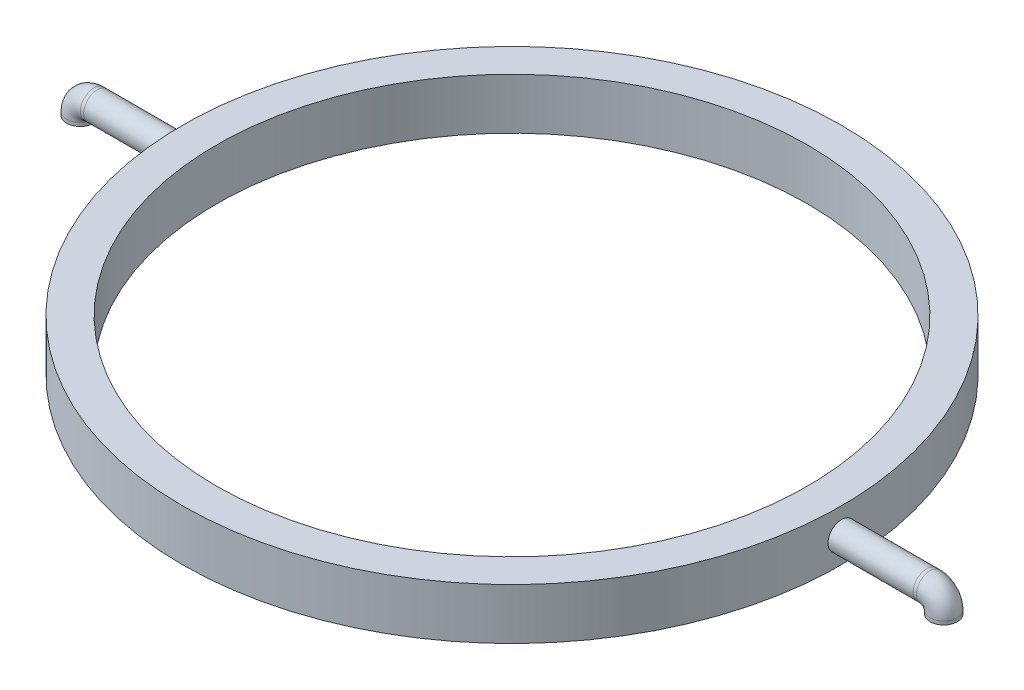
ISO-10303-21;
HEADER;
FILE_DESCRIPTION(('STEP AP214'),'2;1');
FILE_NAME('part.step','',(''),(''),'','','');
FILE_SCHEMA(('AUTOMOTIVE_DESIGN { 1 0 10303 214 1 1 1 1 }'));
ENDSEC;
DATA;
#1=APPLICATION_CONTEXT('core data for automotive mechanical design processes');
#2=APPLICATION_PROTOCOL_DEFINITION('international standard','automotive_design',2000,#1);
#3=PRODUCT_CONTEXT('',#1,'mechanical');
#4=PRODUCT('Part','Part','',(#3));
#5=PRODUCT_RELATED_PRODUCT_CATEGORY('part','',(#4));
#6=PRODUCT_DEFINITION_FORMATION('','',#4);
#7=PRODUCT_DEFINITION_CONTEXT('part definition',#1,'design');
#8=PRODUCT_DEFINITION('design','',#6,#7);
#9=PRODUCT_DEFINITION_SHAPE('','',#8);
#10=(LENGTH_UNIT() NAMED_UNIT(*) SI_UNIT(.MILLI.,.METRE.));
#11=(NAMED_UNIT(*) PLANE_ANGLE_UNIT() SI_UNIT($,.RADIAN.));
#12=(NAMED_UNIT(*) SI_UNIT($,.STERADIAN.) SOLID_ANGLE_UNIT());
#13=UNCERTAINTY_MEASURE_WITH_UNIT(LENGTH_MEASURE(1.E-05),#10,'distance_accuracy_value','');
#14=(GEOMETRIC_REPRESENTATION_CONTEXT(3) GLOBAL_UNCERTAINTY_ASSIGNED_CONTEXT((#13)) GLOBAL_UNIT_ASSIGNED_CONTEXT((#10,
#11,#12)) REPRESENTATION_CONTEXT('',''));
#15=CARTESIAN_POINT('',(0.,0.,0.));
#16=DIRECTION('',(0.,0.,1.));
#17=DIRECTION('',(1.,0.,0.));
#18=AXIS2_PLACEMENT_3D('',#15,#16,#17);
#19=CARTESIAN_POINT('',(-96.8,7.5,0.));
#20=DIRECTION('',(-1.,0.,0.));
#21=DIRECTION('',(0.,0.,-1.));
#22=AXIS2_PLACEMENT_3D('',#19,#20,#21);
#23=PLANE('',#22);
#24=CARTESIAN_POINT('',(-96.8,7.5,0.));
#25=DIRECTION('',(1.,0.,0.));
#26=DIRECTION('',(0.,0.,-1.));
#27=AXIS2_PLACEMENT_3D('',#24,#25,#26);
#28=CIRCLE('',#27,4.);
#29=CARTESIAN_POINT('',(-96.8,7.5,-4.));
#30=VERTEX_POINT('',#29);
#31=EDGE_CURVE('E58',#30,#30,#28,.T.);
#32=ORIENTED_EDGE('',*,*,#31,.T.);
#33=EDGE_LOOP('',(#32));
#34=FACE_BOUND('',#33,.T.);
#35=ADVANCED_FACE('F46',(#34),#23,.F.);
#36=CARTESIAN_POINT('',(-126.8,2.5,0.));
#37=DIRECTION('',(0.,-1.,0.));
#38=DIRECTION('',(0.,0.,-1.));
#39=AXIS2_PLACEMENT_3D('',#36,#37,#38);
#40=PLANE('',#39);
#41=CARTESIAN_POINT('',(-126.8,2.5,0.));
#42=DIRECTION('',(0.,1.,0.));
#43=DIRECTION('',(0.,0.,-1.));
#44=AXIS2_PLACEMENT_3D('',#41,#42,#43);
#45=CIRCLE('',#44,4.);
#46=CARTESIAN_POINT('',(-126.8,2.5,-4.));
#47=VERTEX_POINT('',#46);
#48=EDGE_CURVE('E12',#47,#47,#45,.T.);
#49=ORIENTED_EDGE('',*,*,#48,.F.);
#50=EDGE_LOOP('',(#49));
#51=FACE_BOUND('',#50,.T.);
#52=ADVANCED_FACE('F91',(#51),#40,.T.);
#53=CARTESIAN_POINT('',(-96.8,7.5,0.));
#54=DIRECTION('',(-1.,0.,0.));
#55=DIRECTION('',(0.,1.,0.));
#56=AXIS2_PLACEMENT_3D('',#53,#54,#55);
#57=CYLINDRICAL_SURFACE('',#56,4.);
#58=CARTESIAN_POINT('',(-121.8,7.5,0.));
#59=DIRECTION('',(1.,0.,0.));
#60=DIRECTION('',(0.,0.,-1.));
#61=AXIS2_PLACEMENT_3D('',#58,#59,#60);
#62=CIRCLE('',#61,4.);
#63=CARTESIAN_POINT('',(-121.8,7.5,-4.));
#64=VERTEX_POINT('',#63);
#65=EDGE_CURVE('E71',#64,#64,#62,.T.);
#66=ORIENTED_EDGE('',*,*,#65,.T.);
#67=EDGE_LOOP('',(#66));
#68=FACE_BOUND('',#67,.T.);
#69=ORIENTED_EDGE('',*,*,#31,.F.);
#70=EDGE_LOOP('',(#69));
#71=FACE_BOUND('',#70,.T.);
#72=ADVANCED_FACE('F78',(#68,#71),#57,.T.);
#73=CARTESIAN_POINT('',(-121.8,7.50000000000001,0.));
#74=DIRECTION('',(-1.,0.,0.));
#75=DIRECTION('',(0.,0.,-1.));
#76=AXIS2_PLACEMENT_3D('',#73,#74,#75);
#77=CYLINDRICAL_SURFACE('',#76,4.);
#78=CARTESIAN_POINT('',(-122.8,7.50000000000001,0.));
#79=DIRECTION('',(1.,0.,0.));
#80=DIRECTION('',(0.,0.,-1.));
#81=AXIS2_PLACEMENT_3D('',#78,#79,#80);
#82=CIRCLE('',#81,4.);
#83=CARTESIAN_POINT('',(-122.8,3.5,0.));
#84=VERTEX_POINT('',#83);
#85=EDGE_CURVE('E69',#84,#84,#82,.T.);
#86=ORIENTED_EDGE('',*,*,#85,.T.);
#87=EDGE_LOOP('',(#86));
#88=FACE_BOUND('',#87,.T.);
#89=ORIENTED_EDGE('',*,*,#65,.F.);
#90=EDGE_LOOP('',(#89));
#91=FACE_BOUND('',#90,.T.);
#92=ADVANCED_FACE('F81',(#88,#91),#77,.T.);
#93=CARTESIAN_POINT('',(-118.800000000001,3.5,0.));
#94=DIRECTION('',(0.,1.,0.));
#95=DIRECTION('',(1.,0.,0.));
#96=AXIS2_PLACEMENT_3D('',#93,#94,#95);
#97=CIRCLE('',#96,4.);
#98=TRIMMED_CURVE('',#97,(PARAMETER_VALUE(-3.14159207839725)),
(PARAMETER_VALUE(3.14159207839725)),.T.,.PARAMETER.);
#99=CARTESIAN_POINT('',(-122.8,3.5,0.));
#100=DIRECTION('',(0.,0.,-1.));
#101=AXIS1_PLACEMENT('',#99,#100);
#102=SURFACE_OF_REVOLUTION('',#98,#101);
#103=CARTESIAN_POINT('',(-126.8,3.49999999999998,0.));
#104=DIRECTION('',(0.,1.,0.));
#105=DIRECTION('',(0.,0.,-1.));
#106=AXIS2_PLACEMENT_3D('',#103,#104,#105);
#107=CIRCLE('',#106,4.);
#108=EDGE_CURVE('E53',#84,#84,#107,.T.);
#109=ORIENTED_EDGE('',*,*,#108,.T.);
#110=ORIENTED_EDGE('',*,*,#85,.F.);
#111=EDGE_LOOP('',(#109,#110));
#112=FACE_BOUND('',#111,.T.);
#113=ADVANCED_FACE('F67',(#112),#102,.T.);
#114=CARTESIAN_POINT('',(-126.8,3.49999999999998,0.));
#115=DIRECTION('',(0.,-1.,0.));
#116=DIRECTION('',(0.,0.,-1.));
#117=AXIS2_PLACEMENT_3D('',#114,#115,#116);
#118=CYLINDRICAL_SURFACE('',#117,4.);
#119=ORIENTED_EDGE('',*,*,#48,.T.);
#120=EDGE_LOOP('',(#119));
#121=FACE_BOUND('',#120,.T.);
#122=ORIENTED_EDGE('',*,*,#108,.F.);
#123=EDGE_LOOP('',(#122));
#124=FACE_BOUND('',#123,.T.);
#125=ADVANCED_FACE('F89',(#121,#124),#118,.T.);
#126=CLOSED_SHELL('',(#35,#52,#72,#92,#113,#125));
#127=MANIFOLD_SOLID_BREP('B2',#126);
#128=CARTESIAN_POINT('',(96.8,7.5,0.));
#129=DIRECTION('',(1.,0.,0.));
#130=DIRECTION('',(0.,0.,-1.));
#131=AXIS2_PLACEMENT_3D('',#128,#129,#130);
#132=PLANE('',#131);
#133=CARTESIAN_POINT('',(96.8,7.5,0.));
#134=DIRECTION('',(1.,0.,0.));
#135=DIRECTION('',(0.,0.,-1.));
#136=AXIS2_PLACEMENT_3D('',#133,#134,#135);
#137=CIRCLE('',#136,4.);
#138=CARTESIAN_POINT('',(96.8,7.5,-4.));
#139=VERTEX_POINT('',#138);
#140=EDGE_CURVE('E154',#139,#139,#137,.T.);
#141=ORIENTED_EDGE('',*,*,#140,.F.);
#142=EDGE_LOOP('',(#141));
#143=FACE_BOUND('',#142,.T.);
#144=ADVANCED_FACE('F142',(#143),#132,.F.);
#145=CARTESIAN_POINT('',(126.8,2.5,0.));
#146=DIRECTION('',(0.,-1.,0.));
#147=DIRECTION('',(0.,0.,-1.));
#148=AXIS2_PLACEMENT_3D('',#145,#146,#147);
#149=PLANE('',#148);
#150=CARTESIAN_POINT('',(126.8,2.5,0.));
#151=DIRECTION('',(0.,-1.,0.));
#152=DIRECTION('',(0.,0.,-1.));
#153=AXIS2_PLACEMENT_3D('',#150,#151,#152);
#154=CIRCLE('',#153,4.);
#155=CARTESIAN_POINT('',(126.8,2.5,-4.));
#156=VERTEX_POINT('',#155);
#157=EDGE_CURVE('E44',#156,#156,#154,.T.);
#158=ORIENTED_EDGE('',*,*,#157,.T.);
#159=EDGE_LOOP('',(#158));
#160=FACE_BOUND('',#159,.T.);
#161=ADVANCED_FACE('F176',(#160),#149,.T.);
#162=CARTESIAN_POINT('',(96.8,7.5,0.));
#163=DIRECTION('',(1.,0.,0.));
#164=DIRECTION('',(0.,1.,0.));
#165=AXIS2_PLACEMENT_3D('',#162,#163,#164);
#166=CYLINDRICAL_SURFACE('',#165,4.);
#167=CARTESIAN_POINT('',(121.8,7.5,0.));
#168=DIRECTION('',(1.,0.,0.));
#169=DIRECTION('',(0.,0.,-1.));
#170=AXIS2_PLACEMENT_3D('',#167,#168,#169);
#171=CIRCLE('',#170,4.);
#172=CARTESIAN_POINT('',(121.8,7.5,-4.));
#173=VERTEX_POINT('',#172);
#174=EDGE_CURVE('E168',#173,#173,#171,.T.);
#175=ORIENTED_EDGE('',*,*,#174,.F.);
#176=EDGE_LOOP('',(#175));
#177=FACE_BOUND('',#176,.T.);
#178=ORIENTED_EDGE('',*,*,#140,.T.);
#179=EDGE_LOOP('',(#178));
#180=FACE_BOUND('',#179,.T.);
#181=ADVANCED_FACE('F174',(#177,#180),#166,.T.);
#182=CARTESIAN_POINT('',(121.8,7.50000000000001,0.));
#183=DIRECTION('',(1.,0.,0.));
#184=DIRECTION('',(0.,0.,-1.));
#185=AXIS2_PLACEMENT_3D('',#182,#183,#184);
#186=CYLINDRICAL_SURFACE('',#185,4.);
#187=CARTESIAN_POINT('',(122.8,7.50000000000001,0.));
#188=DIRECTION('',(1.,0.,0.));
#189=DIRECTION('',(0.,0.,-1.));
#190=AXIS2_PLACEMENT_3D('',#187,#188,#189);
#191=CIRCLE('',#190,4.);
#192=CARTESIAN_POINT('',(122.8,3.5,0.));
#193=VERTEX_POINT('',#192);
#194=EDGE_CURVE('E162',#193,#193,#191,.T.);
#195=ORIENTED_EDGE('',*,*,#194,.F.);
#196=EDGE_LOOP('',(#195));
#197=FACE_BOUND('',#196,.T.);
#198=ORIENTED_EDGE('',*,*,#174,.T.);
#199=EDGE_LOOP('',(#198));
#200=FACE_BOUND('',#199,.T.);
#201=ADVANCED_FACE('F163',(#197,#200),#186,.T.);
#202=CARTESIAN_POINT('',(118.800000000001,3.5,0.));
#203=DIRECTION('',(0.,-1.,0.));
#204=DIRECTION('',(-1.,0.,0.));
#205=AXIS2_PLACEMENT_3D('',#202,#203,#204);
#206=CIRCLE('',#205,4.);
#207=TRIMMED_CURVE('',#206,(PARAMETER_VALUE(-3.14159207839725)),
(PARAMETER_VALUE(3.14159207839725)),.T.,.PARAMETER.);
#208=CARTESIAN_POINT('',(122.8,3.5,0.));
#209=DIRECTION('',(0.,0.,-1.));
#210=AXIS1_PLACEMENT('',#208,#209);
#211=SURFACE_OF_REVOLUTION('',#207,#210);
#212=CARTESIAN_POINT('',(126.8,3.49999999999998,0.));
#213=DIRECTION('',(0.,-1.,0.));
#214=DIRECTION('',(0.,0.,-1.));
#215=AXIS2_PLACEMENT_3D('',#212,#213,#214);
#216=CIRCLE('',#215,4.);
#217=EDGE_CURVE('E149',#193,#193,#216,.T.);
#218=ORIENTED_EDGE('',*,*,#217,.F.);
#219=ORIENTED_EDGE('',*,*,#194,.T.);
#220=EDGE_LOOP('',(#218,#219));
#221=FACE_BOUND('',#220,.T.);
#222=ADVANCED_FACE('F183',(#221),#211,.T.);
#223=CARTESIAN_POINT('',(126.8,3.49999999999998,0.));
#224=DIRECTION('',(0.,-1.,0.));
#225=DIRECTION('',(0.,0.,-1.));
#226=AXIS2_PLACEMENT_3D('',#223,#224,#225);
#227=CYLINDRICAL_SURFACE('',#226,4.);
#228=ORIENTED_EDGE('',*,*,#157,.F.);
#229=EDGE_LOOP('',(#228));
#230=FACE_BOUND('',#229,.T.);
#231=ORIENTED_EDGE('',*,*,#217,.T.);
#232=EDGE_LOOP('',(#231));
#233=FACE_BOUND('',#232,.T.);
#234=ADVANCED_FACE('F186',(#230,#233),#227,.T.);
#235=CLOSED_SHELL('',(#144,#161,#181,#201,#222,#234));
#236=MANIFOLD_SOLID_BREP('B6',#235);
#237=CARTESIAN_POINT('',(0.,0.,0.));
#238=DIRECTION('',(0.,-1.,0.));
#239=DIRECTION('',(0.,0.,-1.));
#240=AXIS2_PLACEMENT_3D('',#237,#238,#239);
#241=CYLINDRICAL_SURFACE('',#240,86.8);
#242=CARTESIAN_POINT('',(0.,15.,0.));
#243=DIRECTION('',(0.,-1.,0.));
#244=DIRECTION('',(0.,0.,-1.));
#245=AXIS2_PLACEMENT_3D('',#242,#243,#244);
#246=CIRCLE('',#245,86.8);
#247=CARTESIAN_POINT('',(0.,15.,-86.8));
#248=VERTEX_POINT('',#247);
#249=EDGE_CURVE('E245',#248,#248,#246,.T.);
#250=ORIENTED_EDGE('',*,*,#249,.F.);
#251=EDGE_LOOP('',(#250));
#252=FACE_BOUND('',#251,.T.);
#253=CARTESIAN_POINT('',(0.,0.,0.));
#254=DIRECTION('',(0.,-1.,0.));
#255=DIRECTION('',(0.,0.,-1.));
#256=AXIS2_PLACEMENT_3D('',#253,#254,#255);
#257=CIRCLE('',#256,86.8);
#258=CARTESIAN_POINT('',(0.,0.,-86.8));
#259=VERTEX_POINT('',#258);
#260=EDGE_CURVE('E141',#259,#259,#257,.T.);
#261=ORIENTED_EDGE('',*,*,#260,.T.);
#262=EDGE_LOOP('',(#261));
#263=FACE_BOUND('',#262,.T.);
#264=ADVANCED_FACE('F231',(#252,#263),#241,.F.);
#265=CARTESIAN_POINT('',(0.,0.,0.));
#266=DIRECTION('',(0.,-1.,0.));
#267=DIRECTION('',(0.,0.,-1.));
#268=AXIS2_PLACEMENT_3D('',#265,#266,#267);
#269=PLANE('',#268);
#270=CARTESIAN_POINT('',(0.,0.,0.));
#271=DIRECTION('',(0.,-1.,0.));
#272=DIRECTION('',(0.,0.,-1.));
#273=AXIS2_PLACEMENT_3D('',#270,#271,#272);
#274=CIRCLE('',#273,96.8);
#275=CARTESIAN_POINT('',(0.,0.,-96.8));
#276=VERTEX_POINT('',#275);
#277=EDGE_CURVE('E237',#276,#276,#274,.T.);
#278=ORIENTED_EDGE('',*,*,#277,.T.);
#279=EDGE_LOOP('',(#278));
#280=FACE_BOUND('',#279,.T.);
#281=ORIENTED_EDGE('',*,*,#260,.F.);
#282=EDGE_LOOP('',(#281));
#283=FACE_BOUND('',#282,.T.);
#284=ADVANCED_FACE('F254',(#280,#283),#269,.T.);
#285=CARTESIAN_POINT('',(0.,0.,0.));
#286=DIRECTION('',(0.,-1.,0.));
#287=DIRECTION('',(0.,0.,-1.));
#288=AXIS2_PLACEMENT_3D('',#285,#286,#287);
#289=CYLINDRICAL_SURFACE('',#288,96.8);
#290=ORIENTED_EDGE('',*,*,#277,.F.);
#291=EDGE_LOOP('',(#290));
#292=FACE_BOUND('',#291,.T.);
#293=CARTESIAN_POINT('',(0.,15.,0.));
#294=DIRECTION('',(0.,-1.,0.));
#295=DIRECTION('',(0.,0.,-1.));
#296=AXIS2_PLACEMENT_3D('',#293,#294,#295);
#297=CIRCLE('',#296,96.8);
#298=CARTESIAN_POINT('',(0.,15.,-96.8));
#299=VERTEX_POINT('',#298);
#300=EDGE_CURVE('E241',#299,#299,#297,.T.);
#301=ORIENTED_EDGE('',*,*,#300,.T.);
#302=EDGE_LOOP('',(#301));
#303=FACE_BOUND('',#302,.T.);
#304=ADVANCED_FACE('F258',(#292,#303),#289,.T.);
#305=CARTESIAN_POINT('',(0.,15.,0.));
#306=DIRECTION('',(0.,-1.,0.));
#307=DIRECTION('',(0.,0.,-1.));
#308=AXIS2_PLACEMENT_3D('',#305,#306,#307);
#309=PLANE('',#308);
#310=ORIENTED_EDGE('',*,*,#300,.F.);
#311=EDGE_LOOP('',(#310));
#312=FACE_BOUND('',#311,.T.);
#313=ORIENTED_EDGE('',*,*,#249,.T.);
#314=EDGE_LOOP('',(#313));
#315=FACE_BOUND('',#314,.T.);
#316=ADVANCED_FACE('F251',(#312,#315),#309,.F.);
#317=CLOSED_SHELL('',(#264,#284,#304,#316));
#318=MANIFOLD_SOLID_BREP('B38',#317);
#319=ADVANCED_BREP_SHAPE_REPRESENTATION('',(#18,#127,#236,#318),#14);
#320=SHAPE_DEFINITION_REPRESENTATION(#9,#319);
ENDSEC;
END-ISO-10303-21;
